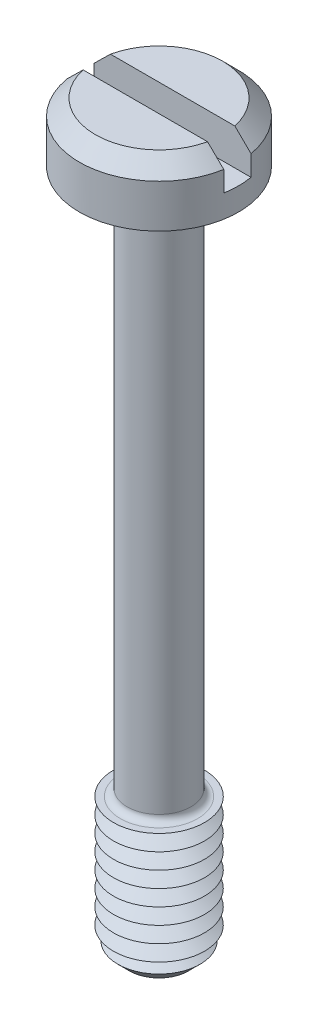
ISO-10303-21;
HEADER;
FILE_DESCRIPTION(('STEP AP214'),'2;1');
FILE_NAME('part.step','',(''),(''),'','','');
FILE_SCHEMA(('AUTOMOTIVE_DESIGN { 1 0 10303 214 1 1 1 1 }'));
ENDSEC;
DATA;
#1=APPLICATION_CONTEXT('core data for automotive mechanical design processes');
#2=APPLICATION_PROTOCOL_DEFINITION('international standard','automotive_design',2000,#1);
#3=PRODUCT_CONTEXT('',#1,'mechanical');
#4=PRODUCT('Part','Part','',(#3));
#5=PRODUCT_RELATED_PRODUCT_CATEGORY('part','',(#4));
#6=PRODUCT_DEFINITION_FORMATION('','',#4);
#7=PRODUCT_DEFINITION_CONTEXT('part definition',#1,'design');
#8=PRODUCT_DEFINITION('design','',#6,#7);
#9=PRODUCT_DEFINITION_SHAPE('','',#8);
#10=(LENGTH_UNIT() NAMED_UNIT(*) SI_UNIT(.MILLI.,.METRE.));
#11=(NAMED_UNIT(*) PLANE_ANGLE_UNIT() SI_UNIT($,.RADIAN.));
#12=(NAMED_UNIT(*) SI_UNIT($,.STERADIAN.) SOLID_ANGLE_UNIT());
#13=UNCERTAINTY_MEASURE_WITH_UNIT(LENGTH_MEASURE(1.E-05),#10,'distance_accuracy_value','');
#14=(GEOMETRIC_REPRESENTATION_CONTEXT(3) GLOBAL_UNCERTAINTY_ASSIGNED_CONTEXT((#13)) GLOBAL_UNIT_ASSIGNED_CONTEXT((#10,
#11,#12)) REPRESENTATION_CONTEXT('',''));
#15=CARTESIAN_POINT('',(0.,0.,0.));
#16=DIRECTION('',(0.,0.,1.));
#17=DIRECTION('',(1.,0.,0.));
#18=AXIS2_PLACEMENT_3D('',#15,#16,#17);
#19=CARTESIAN_POINT('',(0.,2.6,0.));
#20=DIRECTION('',(0.,1.,0.));
#21=DIRECTION('',(0.,0.,1.));
#22=AXIS2_PLACEMENT_3D('',#19,#20,#21);
#23=PLANE('',#22);
#24=DIRECTION('',(-1.,0.,0.));
#25=VECTOR('',#24,1.);
#26=CARTESIAN_POINT('',(3.5,2.6,-0.6));
#27=LINE('',#26,#25);
#28=CARTESIAN_POINT('',(2.73495886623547,2.6,-0.6));
#29=VERTEX_POINT('',#28);
#30=CARTESIAN_POINT('',(-2.73495886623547,2.6,-0.6));
#31=VERTEX_POINT('',#30);
#32=EDGE_CURVE('E110',#29,#31,#27,.T.);
#33=ORIENTED_EDGE('',*,*,#32,.F.);
#34=CARTESIAN_POINT('',(0.,2.6,0.));
#35=DIRECTION('',(0.,1.,0.));
#36=DIRECTION('',(0.,0.,1.));
#37=AXIS2_PLACEMENT_3D('',#34,#35,#36);
#38=CIRCLE('',#37,2.8);
#39=EDGE_CURVE('E113',#29,#31,#38,.T.);
#40=ORIENTED_EDGE('',*,*,#39,.T.);
#41=EDGE_LOOP('',(#33,#40));
#42=FACE_BOUND('',#41,.T.);
#43=ADVANCED_FACE('F39',(#42),#23,.T.);
#44=CARTESIAN_POINT('',(0.,2.6,0.));
#45=DIRECTION('',(0.,-1.,0.));
#46=DIRECTION('',(0.,0.,-1.));
#47=AXIS2_PLACEMENT_3D('',#44,#45,#46);
#48=CONICAL_SURFACE('',#47,2.8,0.785398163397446);
#49=CARTESIAN_POINT('',(7.69779986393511,-2.32114776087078,-0.6));
#50=CARTESIAN_POINT('',(7.42456340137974,-2.0487448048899,-0.6));
#51=CARTESIAN_POINT('',(7.15128998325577,-1.77637887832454,-0.6));
#52=CARTESIAN_POINT('',(6.60460779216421,-1.23176088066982,-0.6));
#53=CARTESIAN_POINT('',(6.3311990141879,-0.959508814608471,-0.6));
#54=CARTESIAN_POINT('',(5.78393918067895,-0.41491410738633,-0.6));
#55=CARTESIAN_POINT('',(5.51008795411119,-0.142571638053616,-0.6));
#56=CARTESIAN_POINT('',(4.96212493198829,0.401829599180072,-0.6));
#57=CARTESIAN_POINT('',(4.68801314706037,0.673888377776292,-0.6));
#58=CARTESIAN_POINT('',(4.15230810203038,1.204717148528,-0.6));
#59=CARTESIAN_POINT('',(3.89073524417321,1.4635077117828,-0.6));
#60=CARTESIAN_POINT('',(3.49781694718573,1.85115830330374,-0.6));
#61=CARTESIAN_POINT('',(3.36674319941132,1.98029362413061,-0.6));
#62=CARTESIAN_POINT('',(3.10433907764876,2.23830030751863,-0.6));
#63=CARTESIAN_POINT('',(2.97300870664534,2.36717167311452,-0.6));
#64=CARTESIAN_POINT('',(2.71005235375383,2.62445652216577,-0.6));
#65=CARTESIAN_POINT('',(2.57842659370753,2.75287023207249,-0.6));
#66=CARTESIAN_POINT('',(2.31459302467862,3.00911021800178,-0.6));
#67=CARTESIAN_POINT('',(2.1823851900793,3.13693646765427,-0.6));
#68=CARTESIAN_POINT('',(1.91706128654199,3.39159289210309,-0.6));
#69=CARTESIAN_POINT('',(1.78394541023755,3.51842326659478,-0.6));
#70=CARTESIAN_POINT('',(1.58297454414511,3.70728046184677,-0.6));
#71=CARTESIAN_POINT('',(1.51577053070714,3.76999922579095,-0.6));
#72=CARTESIAN_POINT('',(1.38073587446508,3.89475766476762,-0.6));
#73=CARTESIAN_POINT('',(1.31290524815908,3.95679735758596,-0.6));
#74=CARTESIAN_POINT('',(1.20662362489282,4.05253127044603,-0.6));
#75=CARTESIAN_POINT('',(1.16849592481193,4.08658409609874,-0.6));
#76=CARTESIAN_POINT('',(1.09186306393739,4.15427097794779,-0.6));
#77=CARTESIAN_POINT('',(1.05335786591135,4.18790499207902,-0.6));
#78=CARTESIAN_POINT('',(0.975560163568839,4.25487029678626,-0.6));
#79=CARTESIAN_POINT('',(0.936263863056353,4.28819718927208,-0.6));
#80=CARTESIAN_POINT('',(0.857023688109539,4.35405392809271,-0.6));
#81=CARTESIAN_POINT('',(0.817079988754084,4.38658398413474,-0.6));
#82=CARTESIAN_POINT('',(0.735932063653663,4.45080389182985,-0.6));
#83=CARTESIAN_POINT('',(0.694719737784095,4.48248357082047,-0.6));
#84=CARTESIAN_POINT('',(0.611023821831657,4.54411116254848,-0.6));
#85=CARTESIAN_POINT('',(0.568540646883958,4.57405963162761,-0.6));
#86=CARTESIAN_POINT('',(0.482031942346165,4.63104137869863,-0.6));
#87=CARTESIAN_POINT('',(0.438018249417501,4.65809235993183,-0.6));
#88=CARTESIAN_POINT('',(0.347545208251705,4.70764477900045,-0.6));
#89=CARTESIAN_POINT('',(0.301093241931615,4.73015905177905,-0.6));
#90=CARTESIAN_POINT('',(0.216840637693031,4.76288589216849,-0.6));
#91=CARTESIAN_POINT('',(0.179711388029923,4.77476119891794,-0.6));
#92=CARTESIAN_POINT('',(0.104069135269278,4.79214056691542,-0.6));
#93=CARTESIAN_POINT('',(0.0655630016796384,4.7976726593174,-0.6));
#94=CARTESIAN_POINT('',(-0.0121083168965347,4.80113734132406,-0.6));
#95=CARTESIAN_POINT('',(-0.0512762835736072,4.79901215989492,-0.6));
#96=CARTESIAN_POINT('',(-0.128601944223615,4.78758103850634,-0.6));
#97=CARTESIAN_POINT('',(-0.166755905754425,4.77825158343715,-0.6));
#98=CARTESIAN_POINT('',(-0.239985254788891,4.75468984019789,-0.6));
#99=CARTESIAN_POINT('',(-0.275121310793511,4.74063623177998,-0.6));
#100=CARTESIAN_POINT('',(-0.343859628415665,4.70912771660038,-0.6));
#101=CARTESIAN_POINT('',(-0.377459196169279,4.69166709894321,-0.6));
#102=CARTESIAN_POINT('',(-0.443620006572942,4.65431398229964,-0.6));
#103=CARTESIAN_POINT('',(-0.476170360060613,4.6344025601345,-0.6));
#104=CARTESIAN_POINT('',(-0.54020885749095,4.59301144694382,-0.6));
#105=CARTESIAN_POINT('',(-0.571697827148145,4.57153301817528,-0.6));
#106=CARTESIAN_POINT('',(-0.636426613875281,4.52565712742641,-0.6));
#107=CARTESIAN_POINT('',(-0.66959860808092,4.50116466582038,-0.6));
#108=CARTESIAN_POINT('',(-0.735238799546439,4.45125092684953,-0.6));
#109=CARTESIAN_POINT('',(-0.767706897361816,4.42582951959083,-0.6));
#110=CARTESIAN_POINT('',(-0.86434028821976,4.34853769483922,-0.6));
#111=CARTESIAN_POINT('',(-0.927700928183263,4.29566444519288,-0.6));
#112=CARTESIAN_POINT('',(-1.05322030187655,4.18829389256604,-0.6));
#113=CARTESIAN_POINT('',(-1.11537654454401,4.13379371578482,-0.6));
#114=CARTESIAN_POINT('',(-1.23879800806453,4.02383276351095,-0.6));
#115=CARTESIAN_POINT('',(-1.30006349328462,3.96837228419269,-0.6));
#116=CARTESIAN_POINT('',(-1.42182653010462,3.85695373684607,-0.6));
#117=CARTESIAN_POINT('',(-1.4823257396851,3.80099747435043,-0.6));
#118=CARTESIAN_POINT('',(-1.60290045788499,3.68862177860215,-0.6));
#119=CARTESIAN_POINT('',(-1.66297593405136,3.63220231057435,-0.6));
#120=CARTESIAN_POINT('',(-1.84259490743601,3.4625819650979,-0.6));
#121=CARTESIAN_POINT('',(-1.96167258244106,3.3488883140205,-0.6));
#122=CARTESIAN_POINT('',(-2.19942862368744,3.12043467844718,-0.6));
#123=CARTESIAN_POINT('',(-2.3181049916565,3.00567262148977,-0.6));
#124=CARTESIAN_POINT('',(-2.55498513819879,2.77566147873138,-0.6));
#125=CARTESIAN_POINT('',(-2.67318891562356,2.66041239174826,-0.6));
#126=CARTESIAN_POINT('',(-3.02733776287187,2.31418176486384,-0.6));
#127=CARTESIAN_POINT('',(-3.26281496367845,2.08272206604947,-0.6));
#128=CARTESIAN_POINT('',(-3.73326607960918,1.61902814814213,-0.6));
#129=CARTESIAN_POINT('',(-3.96823963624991,1.38679356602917,-0.6));
#130=CARTESIAN_POINT('',(-4.43780370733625,0.921942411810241,-0.6));
#131=CARTESIAN_POINT('',(-4.67239422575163,0.689325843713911,-0.6));
#132=CARTESIAN_POINT('',(-5.13982382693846,0.225350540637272,-0.6));
#133=CARTESIAN_POINT('',(-5.37266445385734,-0.0060066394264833,-0.6));
#134=CARTESIAN_POINT('',(-5.8381854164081,-0.468883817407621,-0.6));
#135=CARTESIAN_POINT('',(-6.07086575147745,-0.700403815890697,-0.6));
#136=CARTESIAN_POINT('',(-6.5359692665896,-1.16341429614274,-0.6));
#137=CARTESIAN_POINT('',(-6.76839251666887,-1.39490470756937,-0.6));
#138=CARTESIAN_POINT('',(-7.23315324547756,-1.85796986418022,-0.6));
#139=CARTESIAN_POINT('',(-7.46549072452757,-2.08954460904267,-0.6));
#140=CARTESIAN_POINT('',(-7.69779986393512,-2.32114776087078,-0.6));
#141=B_SPLINE_CURVE_WITH_KNOTS('',3,(#49,#50,#51,#52,#53,#54,#55,#56,#57,#58,#59,#60,#61,#62,
#63,#64,#65,#66,#67,#68,#69,#70,#71,#72,#73,#74,#75,#76,#77,#78,#79,#80,#81,#82,#83,#84,#85,#86,
#87,#88,#89,#90,#91,#92,#93,#94,#95,#96,#97,#98,#99,#100,#101,#102,#103,#104,#105,#106,#107,
#108,#109,#110,#111,#112,#113,#114,#115,#116,#117,#118,#119,#120,#121,#122,#123,#124,#125,#126,
#127,#128,#129,#130,#131,#132,#133,#134,#135,#136,#137,#138,#139,#140),.UNSPECIFIED.,.F.,.F.,(4,
2,2,2,2,2,2,2,2,2,2,2,2,2,2,2,2,2,2,2,2,2,2,2,2,2,2,2,2,2,2,2,2,2,2,2,2,2,2,2,2,2,2,2,2,4),(0.,
1.15747738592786,2.31500139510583,3.47365747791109,4.6322681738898,5.73614050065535,
6.28814234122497,6.84013779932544,7.39180548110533,7.94349768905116,8.49507629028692,
8.7708456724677,9.04660781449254,9.19996738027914,9.35334222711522,9.50791164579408,
9.66243993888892,9.81835637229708,9.97422241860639,10.1290741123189,10.2834813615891,
10.4000294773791,10.5160605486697,10.6329688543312,10.7502603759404,10.8635386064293,
10.9770083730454,11.0914168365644,11.205734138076,11.3294140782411,11.4531113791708,
11.7006314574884,11.9486181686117,12.1965297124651,12.4437540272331,12.6909970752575,
13.184904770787,13.6801705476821,14.1754375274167,15.1659939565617,16.1571087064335,
17.1482131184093,18.1329303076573,19.1176509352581,20.1017623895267,21.0858701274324),.UNSPECIFIED.);
#142=CARTESIAN_POINT('',(3.44818792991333,1.9,-0.6));
#143=VERTEX_POINT('',#142);
#144=EDGE_CURVE('E260',#143,#29,#141,.T.);
#145=ORIENTED_EDGE('',*,*,#144,.F.);
#146=CARTESIAN_POINT('',(0.,1.9,0.));
#147=DIRECTION('',(0.,1.,0.));
#148=DIRECTION('',(0.,0.,1.));
#149=AXIS2_PLACEMENT_3D('',#146,#147,#148);
#150=CIRCLE('',#149,3.5);
#151=CARTESIAN_POINT('',(-3.44818792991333,1.9,-0.6));
#152=VERTEX_POINT('',#151);
#153=EDGE_CURVE('E128',#152,#143,#150,.F.);
#154=ORIENTED_EDGE('',*,*,#153,.F.);
#155=EDGE_CURVE('E102',#31,#152,#141,.T.);
#156=ORIENTED_EDGE('',*,*,#155,.F.);
#157=ORIENTED_EDGE('',*,*,#39,.F.);
#158=EDGE_LOOP('',(#145,#154,#156,#157));
#159=FACE_BOUND('',#158,.T.);
#160=ADVANCED_FACE('F222',(#159),#48,.T.);
#161=CARTESIAN_POINT('',(0.,-30.,0.));
#162=DIRECTION('',(0.,1.,0.));
#163=DIRECTION('',(0.,0.,1.));
#164=AXIS2_PLACEMENT_3D('',#161,#162,#163);
#165=CYLINDRICAL_SURFACE('',#164,1.4);
#166=CARTESIAN_POINT('',(0.,-23.7,0.));
#167=DIRECTION('',(0.,-1.,0.));
#168=DIRECTION('',(0.,0.,-1.));
#169=AXIS2_PLACEMENT_3D('',#166,#167,#168);
#170=CIRCLE('',#169,1.4);
#171=CARTESIAN_POINT('',(0.,-23.7,-1.4));
#172=VERTEX_POINT('',#171);
#173=EDGE_CURVE('E123',#172,#172,#170,.F.);
#174=ORIENTED_EDGE('',*,*,#173,.T.);
#175=EDGE_LOOP('',(#174));
#176=FACE_BOUND('',#175,.T.);
#177=CARTESIAN_POINT('',(0.,-0.300000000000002,0.));
#178=DIRECTION('',(0.,1.,0.));
#179=DIRECTION('',(0.,0.,1.));
#180=AXIS2_PLACEMENT_3D('',#177,#178,#179);
#181=CIRCLE('',#180,1.4);
#182=CARTESIAN_POINT('',(0.,-0.300000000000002,1.4));
#183=VERTEX_POINT('',#182);
#184=EDGE_CURVE('E365',#183,#183,#181,.F.);
#185=ORIENTED_EDGE('',*,*,#184,.T.);
#186=EDGE_LOOP('',(#185));
#187=FACE_BOUND('',#186,.T.);
#188=ADVANCED_FACE('F218',(#176,#187),#165,.T.);
#189=CARTESIAN_POINT('',(0.,2.6,0.));
#190=DIRECTION('',(0.,-1.,0.));
#191=DIRECTION('',(0.,0.,-1.));
#192=AXIS2_PLACEMENT_3D('',#189,#190,#191);
#193=CYLINDRICAL_SURFACE('',#192,3.5);
#194=ORIENTED_EDGE('',*,*,#153,.T.);
#195=DIRECTION('',(0.,-1.,0.));
#196=VECTOR('',#195,1.);
#197=CARTESIAN_POINT('',(3.44818792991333,2.6,-0.6));
#198=LINE('',#197,#196);
#199=CARTESIAN_POINT('',(3.44818792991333,1.,-0.6));
#200=VERTEX_POINT('',#199);
#201=EDGE_CURVE('E64',#143,#200,#198,.T.);
#202=ORIENTED_EDGE('',*,*,#201,.T.);
#203=CARTESIAN_POINT('',(0.,1.,0.));
#204=DIRECTION('',(0.,1.,0.));
#205=DIRECTION('',(0.,0.,1.));
#206=AXIS2_PLACEMENT_3D('',#203,#204,#205);
#207=CIRCLE('',#206,3.5);
#208=CARTESIAN_POINT('',(3.44818792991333,1.,0.6));
#209=VERTEX_POINT('',#208);
#210=EDGE_CURVE('E11',#209,#200,#207,.T.);
#211=ORIENTED_EDGE('',*,*,#210,.F.);
#212=DIRECTION('',(0.,-1.,0.));
#213=VECTOR('',#212,1.);
#214=CARTESIAN_POINT('',(3.44818792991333,2.6,0.6));
#215=LINE('',#214,#213);
#216=CARTESIAN_POINT('',(3.44818792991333,1.9,0.6));
#217=VERTEX_POINT('',#216);
#218=EDGE_CURVE('E278',#209,#217,#215,.F.);
#219=ORIENTED_EDGE('',*,*,#218,.T.);
#220=CARTESIAN_POINT('',(-3.44818792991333,1.9,0.6));
#221=VERTEX_POINT('',#220);
#222=EDGE_CURVE('E120',#217,#221,#150,.F.);
#223=ORIENTED_EDGE('',*,*,#222,.T.);
#224=DIRECTION('',(0.,-1.,0.));
#225=VECTOR('',#224,1.);
#226=CARTESIAN_POINT('',(-3.44818792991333,2.6,0.6));
#227=LINE('',#226,#225);
#228=CARTESIAN_POINT('',(-3.44818792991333,1.,0.6));
#229=VERTEX_POINT('',#228);
#230=EDGE_CURVE('E96',#221,#229,#227,.T.);
#231=ORIENTED_EDGE('',*,*,#230,.T.);
#232=CARTESIAN_POINT('',(-3.44818792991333,1.,-0.6));
#233=VERTEX_POINT('',#232);
#234=EDGE_CURVE('E44',#233,#229,#207,.T.);
#235=ORIENTED_EDGE('',*,*,#234,.F.);
#236=DIRECTION('',(0.,-1.,0.));
#237=VECTOR('',#236,1.);
#238=CARTESIAN_POINT('',(-3.44818792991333,2.6,-0.6));
#239=LINE('',#238,#237);
#240=EDGE_CURVE('E283',#233,#152,#239,.F.);
#241=ORIENTED_EDGE('',*,*,#240,.T.);
#242=EDGE_LOOP('',(#194,#202,#211,#219,#223,#231,#235,#241));
#243=FACE_BOUND('',#242,.T.);
#244=CARTESIAN_POINT('',(0.,0.,0.));
#245=DIRECTION('',(0.,1.,0.));
#246=DIRECTION('',(0.,0.,1.));
#247=AXIS2_PLACEMENT_3D('',#244,#245,#246);
#248=CIRCLE('',#247,3.5);
#249=CARTESIAN_POINT('',(0.,0.,3.5));
#250=VERTEX_POINT('',#249);
#251=EDGE_CURVE('E351',#250,#250,#248,.T.);
#252=ORIENTED_EDGE('',*,*,#251,.T.);
#253=EDGE_LOOP('',(#252));
#254=FACE_BOUND('',#253,.T.);
#255=ADVANCED_FACE('F221',(#243,#254),#193,.T.);
#256=DIRECTION('',(1.,0.,0.));
#257=VECTOR('',#256,1.);
#258=CARTESIAN_POINT('',(3.5,2.6,0.6));
#259=LINE('',#258,#257);
#260=CARTESIAN_POINT('',(-2.73495886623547,2.6,0.6));
#261=VERTEX_POINT('',#260);
#262=CARTESIAN_POINT('',(2.73495886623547,2.6,0.6));
#263=VERTEX_POINT('',#262);
#264=EDGE_CURVE('E56',#261,#263,#259,.T.);
#265=ORIENTED_EDGE('',*,*,#264,.F.);
#266=EDGE_CURVE('E108',#261,#263,#38,.T.);
#267=ORIENTED_EDGE('',*,*,#266,.T.);
#268=EDGE_LOOP('',(#265,#267));
#269=FACE_BOUND('',#268,.T.);
#270=ADVANCED_FACE('F107',(#269),#23,.T.);
#271=CARTESIAN_POINT('',(0.,0.,0.));
#272=DIRECTION('',(0.,1.,0.));
#273=DIRECTION('',(0.,0.,1.));
#274=AXIS2_PLACEMENT_3D('',#271,#272,#273);
#275=PLANE('',#274);
#276=CARTESIAN_POINT('',(0.,0.,0.));
#277=DIRECTION('',(0.,1.,0.));
#278=DIRECTION('',(0.,0.,1.));
#279=AXIS2_PLACEMENT_3D('',#276,#277,#278);
#280=CIRCLE('',#279,1.7);
#281=CARTESIAN_POINT('',(0.,0.,1.7));
#282=VERTEX_POINT('',#281);
#283=EDGE_CURVE('E114',#282,#282,#280,.T.);
#284=ORIENTED_EDGE('',*,*,#283,.T.);
#285=EDGE_LOOP('',(#284));
#286=FACE_BOUND('',#285,.T.);
#287=ORIENTED_EDGE('',*,*,#251,.F.);
#288=EDGE_LOOP('',(#287));
#289=FACE_BOUND('',#288,.T.);
#290=ADVANCED_FACE('F212',(#286,#289),#275,.F.);
#291=CARTESIAN_POINT('',(0.,-24.,0.));
#292=DIRECTION('',(0.,-1.,0.));
#293=DIRECTION('',(0.,0.,-1.));
#294=AXIS2_PLACEMENT_3D('',#291,#292,#293);
#295=PLANE('',#294);
#296=CARTESIAN_POINT('',(0.,-24.,0.));
#297=DIRECTION('',(0.,-1.,0.));
#298=DIRECTION('',(0.,0.,-1.));
#299=AXIS2_PLACEMENT_3D('',#296,#297,#298);
#300=CIRCLE('',#299,1.7);
#301=CARTESIAN_POINT('',(0.,-24.,-1.7));
#302=VERTEX_POINT('',#301);
#303=EDGE_CURVE('E359',#302,#302,#300,.T.);
#304=ORIENTED_EDGE('',*,*,#303,.T.);
#305=EDGE_LOOP('',(#304));
#306=FACE_BOUND('',#305,.T.);
#307=CARTESIAN_POINT('',(0.,-24.,0.));
#308=DIRECTION('',(0.,1.,0.));
#309=DIRECTION('',(0.,0.,1.));
#310=AXIS2_PLACEMENT_3D('',#307,#308,#309);
#311=CIRCLE('',#310,2.);
#312=CARTESIAN_POINT('',(0.,-24.,2.));
#313=VERTEX_POINT('',#312);
#314=EDGE_CURVE('E347',#313,#313,#311,.T.);
#315=ORIENTED_EDGE('',*,*,#314,.T.);
#316=EDGE_LOOP('',(#315));
#317=FACE_BOUND('',#316,.T.);
#318=ADVANCED_FACE('F208',(#306,#317),#295,.F.);
#319=CARTESIAN_POINT('',(0.,-24.35,0.));
#320=DIRECTION('',(0.,1.,0.));
#321=DIRECTION('',(0.,0.,1.));
#322=AXIS2_PLACEMENT_3D('',#319,#320,#321);
#323=CONICAL_SURFACE('',#322,1.39378221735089,1.0471975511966);
#324=ORIENTED_EDGE('',*,*,#314,.F.);
#325=EDGE_LOOP('',(#324));
#326=FACE_BOUND('',#325,.T.);
#327=CARTESIAN_POINT('',(0.,-24.35,0.));
#328=DIRECTION('',(0.,1.,0.));
#329=DIRECTION('',(0.,0.,1.));
#330=AXIS2_PLACEMENT_3D('',#327,#328,#329);
#331=CIRCLE('',#330,1.39378221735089);
#332=CARTESIAN_POINT('',(0.,-24.35,1.39378221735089));
#333=VERTEX_POINT('',#332);
#334=EDGE_CURVE('E343',#333,#333,#331,.T.);
#335=ORIENTED_EDGE('',*,*,#334,.T.);
#336=EDGE_LOOP('',(#335));
#337=FACE_BOUND('',#336,.T.);
#338=ADVANCED_FACE('F204',(#326,#337),#323,.T.);
#339=CARTESIAN_POINT('',(0.,-24.7,0.));
#340=DIRECTION('',(0.,-1.,0.));
#341=DIRECTION('',(0.,0.,-1.));
#342=AXIS2_PLACEMENT_3D('',#339,#340,#341);
#343=CONICAL_SURFACE('',#342,2.,1.0471975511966);
#344=ORIENTED_EDGE('',*,*,#334,.F.);
#345=EDGE_LOOP('',(#344));
#346=FACE_BOUND('',#345,.T.);
#347=CARTESIAN_POINT('',(0.,-24.7,0.));
#348=DIRECTION('',(0.,1.,0.));
#349=DIRECTION('',(0.,0.,1.));
#350=AXIS2_PLACEMENT_3D('',#347,#348,#349);
#351=CIRCLE('',#350,2.);
#352=CARTESIAN_POINT('',(0.,-24.7,2.));
#353=VERTEX_POINT('',#352);
#354=EDGE_CURVE('E339',#353,#353,#351,.T.);
#355=ORIENTED_EDGE('',*,*,#354,.T.);
#356=EDGE_LOOP('',(#355));
#357=FACE_BOUND('',#356,.T.);
#358=ADVANCED_FACE('F200',(#346,#357),#343,.T.);
#359=CARTESIAN_POINT('',(0.,-25.05,0.));
#360=DIRECTION('',(0.,1.,0.));
#361=DIRECTION('',(0.,0.,1.));
#362=AXIS2_PLACEMENT_3D('',#359,#360,#361);
#363=CONICAL_SURFACE('',#362,1.39378221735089,1.0471975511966);
#364=ORIENTED_EDGE('',*,*,#354,.F.);
#365=EDGE_LOOP('',(#364));
#366=FACE_BOUND('',#365,.T.);
#367=CARTESIAN_POINT('',(0.,-25.05,0.));
#368=DIRECTION('',(0.,1.,0.));
#369=DIRECTION('',(0.,0.,1.));
#370=AXIS2_PLACEMENT_3D('',#367,#368,#369);
#371=CIRCLE('',#370,1.39378221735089);
#372=CARTESIAN_POINT('',(0.,-25.05,1.39378221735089));
#373=VERTEX_POINT('',#372);
#374=EDGE_CURVE('E335',#373,#373,#371,.T.);
#375=ORIENTED_EDGE('',*,*,#374,.T.);
#376=EDGE_LOOP('',(#375));
#377=FACE_BOUND('',#376,.T.);
#378=ADVANCED_FACE('F196',(#366,#377),#363,.T.);
#379=CARTESIAN_POINT('',(0.,-25.4,0.));
#380=DIRECTION('',(0.,-1.,0.));
#381=DIRECTION('',(0.,0.,-1.));
#382=AXIS2_PLACEMENT_3D('',#379,#380,#381);
#383=CONICAL_SURFACE('',#382,2.,1.0471975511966);
#384=ORIENTED_EDGE('',*,*,#374,.F.);
#385=EDGE_LOOP('',(#384));
#386=FACE_BOUND('',#385,.T.);
#387=CARTESIAN_POINT('',(0.,-25.4,0.));
#388=DIRECTION('',(0.,1.,0.));
#389=DIRECTION('',(0.,0.,1.));
#390=AXIS2_PLACEMENT_3D('',#387,#388,#389);
#391=CIRCLE('',#390,2.);
#392=CARTESIAN_POINT('',(0.,-25.4,2.));
#393=VERTEX_POINT('',#392);
#394=EDGE_CURVE('E332',#393,#393,#391,.T.);
#395=ORIENTED_EDGE('',*,*,#394,.T.);
#396=EDGE_LOOP('',(#395));
#397=FACE_BOUND('',#396,.T.);
#398=ADVANCED_FACE('F192',(#386,#397),#383,.T.);
#399=CARTESIAN_POINT('',(0.,-25.75,0.));
#400=DIRECTION('',(0.,1.,0.));
#401=DIRECTION('',(0.,0.,1.));
#402=AXIS2_PLACEMENT_3D('',#399,#400,#401);
#403=CONICAL_SURFACE('',#402,1.39378221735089,1.0471975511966);
#404=ORIENTED_EDGE('',*,*,#394,.F.);
#405=EDGE_LOOP('',(#404));
#406=FACE_BOUND('',#405,.T.);
#407=CARTESIAN_POINT('',(0.,-25.75,0.));
#408=DIRECTION('',(0.,1.,0.));
#409=DIRECTION('',(0.,0.,1.));
#410=AXIS2_PLACEMENT_3D('',#407,#408,#409);
#411=CIRCLE('',#410,1.39378221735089);
#412=CARTESIAN_POINT('',(0.,-25.75,1.39378221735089));
#413=VERTEX_POINT('',#412);
#414=EDGE_CURVE('E329',#413,#413,#411,.T.);
#415=ORIENTED_EDGE('',*,*,#414,.T.);
#416=EDGE_LOOP('',(#415));
#417=FACE_BOUND('',#416,.T.);
#418=ADVANCED_FACE('F188',(#406,#417),#403,.T.);
#419=CARTESIAN_POINT('',(0.,-26.1,0.));
#420=DIRECTION('',(0.,-1.,0.));
#421=DIRECTION('',(0.,0.,-1.));
#422=AXIS2_PLACEMENT_3D('',#419,#420,#421);
#423=CONICAL_SURFACE('',#422,2.,1.0471975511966);
#424=ORIENTED_EDGE('',*,*,#414,.F.);
#425=EDGE_LOOP('',(#424));
#426=FACE_BOUND('',#425,.T.);
#427=CARTESIAN_POINT('',(0.,-26.1,0.));
#428=DIRECTION('',(0.,1.,0.));
#429=DIRECTION('',(0.,0.,1.));
#430=AXIS2_PLACEMENT_3D('',#427,#428,#429);
#431=CIRCLE('',#430,2.);
#432=CARTESIAN_POINT('',(0.,-26.1,2.));
#433=VERTEX_POINT('',#432);
#434=EDGE_CURVE('E326',#433,#433,#431,.T.);
#435=ORIENTED_EDGE('',*,*,#434,.T.);
#436=EDGE_LOOP('',(#435));
#437=FACE_BOUND('',#436,.T.);
#438=ADVANCED_FACE('F184',(#426,#437),#423,.T.);
#439=CARTESIAN_POINT('',(0.,-26.45,0.));
#440=DIRECTION('',(0.,1.,0.));
#441=DIRECTION('',(0.,0.,1.));
#442=AXIS2_PLACEMENT_3D('',#439,#440,#441);
#443=CONICAL_SURFACE('',#442,1.39378221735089,1.0471975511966);
#444=ORIENTED_EDGE('',*,*,#434,.F.);
#445=EDGE_LOOP('',(#444));
#446=FACE_BOUND('',#445,.T.);
#447=CARTESIAN_POINT('',(0.,-26.45,0.));
#448=DIRECTION('',(0.,1.,0.));
#449=DIRECTION('',(0.,0.,1.));
#450=AXIS2_PLACEMENT_3D('',#447,#448,#449);
#451=CIRCLE('',#450,1.39378221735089);
#452=CARTESIAN_POINT('',(0.,-26.45,1.39378221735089));
#453=VERTEX_POINT('',#452);
#454=EDGE_CURVE('E323',#453,#453,#451,.T.);
#455=ORIENTED_EDGE('',*,*,#454,.T.);
#456=EDGE_LOOP('',(#455));
#457=FACE_BOUND('',#456,.T.);
#458=ADVANCED_FACE('F180',(#446,#457),#443,.T.);
#459=CARTESIAN_POINT('',(0.,-26.8,0.));
#460=DIRECTION('',(0.,-1.,0.));
#461=DIRECTION('',(0.,0.,-1.));
#462=AXIS2_PLACEMENT_3D('',#459,#460,#461);
#463=CONICAL_SURFACE('',#462,2.,1.0471975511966);
#464=ORIENTED_EDGE('',*,*,#454,.F.);
#465=EDGE_LOOP('',(#464));
#466=FACE_BOUND('',#465,.T.);
#467=CARTESIAN_POINT('',(0.,-26.8,0.));
#468=DIRECTION('',(0.,1.,0.));
#469=DIRECTION('',(0.,0.,1.));
#470=AXIS2_PLACEMENT_3D('',#467,#468,#469);
#471=CIRCLE('',#470,2.);
#472=CARTESIAN_POINT('',(0.,-26.8,2.));
#473=VERTEX_POINT('',#472);
#474=EDGE_CURVE('E319',#473,#473,#471,.T.);
#475=ORIENTED_EDGE('',*,*,#474,.T.);
#476=EDGE_LOOP('',(#475));
#477=FACE_BOUND('',#476,.T.);
#478=ADVANCED_FACE('F176',(#466,#477),#463,.T.);
#479=CARTESIAN_POINT('',(0.,-27.15,0.));
#480=DIRECTION('',(0.,1.,0.));
#481=DIRECTION('',(0.,0.,1.));
#482=AXIS2_PLACEMENT_3D('',#479,#480,#481);
#483=CONICAL_SURFACE('',#482,1.39378221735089,1.0471975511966);
#484=ORIENTED_EDGE('',*,*,#474,.F.);
#485=EDGE_LOOP('',(#484));
#486=FACE_BOUND('',#485,.T.);
#487=CARTESIAN_POINT('',(0.,-27.15,0.));
#488=DIRECTION('',(0.,1.,0.));
#489=DIRECTION('',(0.,0.,1.));
#490=AXIS2_PLACEMENT_3D('',#487,#488,#489);
#491=CIRCLE('',#490,1.39378221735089);
#492=CARTESIAN_POINT('',(0.,-27.15,1.39378221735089));
#493=VERTEX_POINT('',#492);
#494=EDGE_CURVE('E315',#493,#493,#491,.T.);
#495=ORIENTED_EDGE('',*,*,#494,.T.);
#496=EDGE_LOOP('',(#495));
#497=FACE_BOUND('',#496,.T.);
#498=ADVANCED_FACE('F172',(#486,#497),#483,.T.);
#499=CARTESIAN_POINT('',(0.,-27.5,0.));
#500=DIRECTION('',(0.,-1.,0.));
#501=DIRECTION('',(0.,0.,-1.));
#502=AXIS2_PLACEMENT_3D('',#499,#500,#501);
#503=CONICAL_SURFACE('',#502,2.,1.0471975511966);
#504=ORIENTED_EDGE('',*,*,#494,.F.);
#505=EDGE_LOOP('',(#504));
#506=FACE_BOUND('',#505,.T.);
#507=CARTESIAN_POINT('',(0.,-27.5,0.));
#508=DIRECTION('',(0.,1.,0.));
#509=DIRECTION('',(0.,0.,1.));
#510=AXIS2_PLACEMENT_3D('',#507,#508,#509);
#511=CIRCLE('',#510,2.);
#512=CARTESIAN_POINT('',(0.,-27.5,2.));
#513=VERTEX_POINT('',#512);
#514=EDGE_CURVE('E311',#513,#513,#511,.T.);
#515=ORIENTED_EDGE('',*,*,#514,.T.);
#516=EDGE_LOOP('',(#515));
#517=FACE_BOUND('',#516,.T.);
#518=ADVANCED_FACE('F168',(#506,#517),#503,.T.);
#519=CARTESIAN_POINT('',(0.,-27.85,0.));
#520=DIRECTION('',(0.,1.,0.));
#521=DIRECTION('',(0.,0.,1.));
#522=AXIS2_PLACEMENT_3D('',#519,#520,#521);
#523=CONICAL_SURFACE('',#522,1.39378221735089,1.0471975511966);
#524=ORIENTED_EDGE('',*,*,#514,.F.);
#525=EDGE_LOOP('',(#524));
#526=FACE_BOUND('',#525,.T.);
#527=CARTESIAN_POINT('',(0.,-27.85,0.));
#528=DIRECTION('',(0.,1.,0.));
#529=DIRECTION('',(0.,0.,1.));
#530=AXIS2_PLACEMENT_3D('',#527,#528,#529);
#531=CIRCLE('',#530,1.39378221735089);
#532=CARTESIAN_POINT('',(0.,-27.85,1.39378221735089));
#533=VERTEX_POINT('',#532);
#534=EDGE_CURVE('E307',#533,#533,#531,.T.);
#535=ORIENTED_EDGE('',*,*,#534,.T.);
#536=EDGE_LOOP('',(#535));
#537=FACE_BOUND('',#536,.T.);
#538=ADVANCED_FACE('F164',(#526,#537),#523,.T.);
#539=CARTESIAN_POINT('',(0.,-28.2,0.));
#540=DIRECTION('',(0.,-1.,0.));
#541=DIRECTION('',(0.,0.,-1.));
#542=AXIS2_PLACEMENT_3D('',#539,#540,#541);
#543=CONICAL_SURFACE('',#542,2.,1.0471975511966);
#544=ORIENTED_EDGE('',*,*,#534,.F.);
#545=EDGE_LOOP('',(#544));
#546=FACE_BOUND('',#545,.T.);
#547=CARTESIAN_POINT('',(0.,-28.2,0.));
#548=DIRECTION('',(0.,1.,0.));
#549=DIRECTION('',(0.,0.,1.));
#550=AXIS2_PLACEMENT_3D('',#547,#548,#549);
#551=CIRCLE('',#550,2.);
#552=CARTESIAN_POINT('',(0.,-28.2,2.));
#553=VERTEX_POINT('',#552);
#554=EDGE_CURVE('E303',#553,#553,#551,.T.);
#555=ORIENTED_EDGE('',*,*,#554,.T.);
#556=EDGE_LOOP('',(#555));
#557=FACE_BOUND('',#556,.T.);
#558=ADVANCED_FACE('F160',(#546,#557),#543,.T.);
#559=CARTESIAN_POINT('',(0.,-28.55,0.));
#560=DIRECTION('',(0.,1.,0.));
#561=DIRECTION('',(0.,0.,1.));
#562=AXIS2_PLACEMENT_3D('',#559,#560,#561);
#563=CONICAL_SURFACE('',#562,1.39378221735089,1.0471975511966);
#564=ORIENTED_EDGE('',*,*,#554,.F.);
#565=EDGE_LOOP('',(#564));
#566=FACE_BOUND('',#565,.T.);
#567=CARTESIAN_POINT('',(0.,-28.55,0.));
#568=DIRECTION('',(0.,1.,0.));
#569=DIRECTION('',(0.,0.,1.));
#570=AXIS2_PLACEMENT_3D('',#567,#568,#569);
#571=CIRCLE('',#570,1.39378221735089);
#572=CARTESIAN_POINT('',(0.,-28.55,1.39378221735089));
#573=VERTEX_POINT('',#572);
#574=EDGE_CURVE('E300',#573,#573,#571,.T.);
#575=ORIENTED_EDGE('',*,*,#574,.T.);
#576=EDGE_LOOP('',(#575));
#577=FACE_BOUND('',#576,.T.);
#578=ADVANCED_FACE('F156',(#566,#577),#563,.T.);
#579=CARTESIAN_POINT('',(0.,-28.9,0.));
#580=DIRECTION('',(0.,-1.,0.));
#581=DIRECTION('',(0.,0.,-1.));
#582=AXIS2_PLACEMENT_3D('',#579,#580,#581);
#583=CONICAL_SURFACE('',#582,2.,1.0471975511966);
#584=ORIENTED_EDGE('',*,*,#574,.F.);
#585=EDGE_LOOP('',(#584));
#586=FACE_BOUND('',#585,.T.);
#587=CARTESIAN_POINT('',(0.,-28.9,0.));
#588=DIRECTION('',(0.,1.,0.));
#589=DIRECTION('',(0.,0.,1.));
#590=AXIS2_PLACEMENT_3D('',#587,#588,#589);
#591=CIRCLE('',#590,2.);
#592=CARTESIAN_POINT('',(0.,-28.9,2.));
#593=VERTEX_POINT('',#592);
#594=EDGE_CURVE('E295',#593,#593,#591,.T.);
#595=ORIENTED_EDGE('',*,*,#594,.T.);
#596=EDGE_LOOP('',(#595));
#597=FACE_BOUND('',#596,.T.);
#598=ADVANCED_FACE('F152',(#586,#597),#583,.T.);
#599=CARTESIAN_POINT('',(0.,-29.25,0.));
#600=DIRECTION('',(0.,1.,0.));
#601=DIRECTION('',(0.,0.,1.));
#602=AXIS2_PLACEMENT_3D('',#599,#600,#601);
#603=CONICAL_SURFACE('',#602,1.39378221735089,1.0471975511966);
#604=ORIENTED_EDGE('',*,*,#594,.F.);
#605=EDGE_LOOP('',(#604));
#606=FACE_BOUND('',#605,.T.);
#607=CARTESIAN_POINT('',(0.,-29.25,0.));
#608=DIRECTION('',(0.,1.,0.));
#609=DIRECTION('',(0.,0.,1.));
#610=AXIS2_PLACEMENT_3D('',#607,#608,#609);
#611=CIRCLE('',#610,1.39378221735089);
#612=CARTESIAN_POINT('',(0.,-29.25,1.39378221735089));
#613=VERTEX_POINT('',#612);
#614=EDGE_CURVE('E291',#613,#613,#611,.T.);
#615=ORIENTED_EDGE('',*,*,#614,.T.);
#616=EDGE_LOOP('',(#615));
#617=FACE_BOUND('',#616,.T.);
#618=ADVANCED_FACE('F148',(#606,#617),#603,.T.);
#619=CARTESIAN_POINT('',(0.,-29.6,0.));
#620=DIRECTION('',(0.,-1.,0.));
#621=DIRECTION('',(0.,0.,-1.));
#622=AXIS2_PLACEMENT_3D('',#619,#620,#621);
#623=CONICAL_SURFACE('',#622,2.,1.0471975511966);
#624=CARTESIAN_POINT('',(0.,-29.4901923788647,0.));
#625=DIRECTION('',(0.,-1.,0.));
#626=DIRECTION('',(0.,0.,-1.));
#627=AXIS2_PLACEMENT_3D('',#624,#625,#626);
#628=CIRCLE('',#627,1.80980762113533);
#629=CARTESIAN_POINT('',(0.,-29.4901923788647,1.80980762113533));
#630=VERTEX_POINT('',#629);
#631=EDGE_CURVE('E299',#630,#630,#628,.F.);
#632=ORIENTED_EDGE('',*,*,#631,.T.);
#633=EDGE_LOOP('',(#632));
#634=FACE_BOUND('',#633,.T.);
#635=ORIENTED_EDGE('',*,*,#614,.F.);
#636=EDGE_LOOP('',(#635));
#637=FACE_BOUND('',#636,.T.);
#638=ADVANCED_FACE('F144',(#634,#637),#623,.T.);
#639=CARTESIAN_POINT('',(0.,-30.,0.));
#640=DIRECTION('',(0.,-1.,0.));
#641=DIRECTION('',(0.,0.,-1.));
#642=AXIS2_PLACEMENT_3D('',#639,#640,#641);
#643=PLANE('',#642);
#644=CARTESIAN_POINT('',(0.,-30.,0.));
#645=DIRECTION('',(0.,-1.,0.));
#646=DIRECTION('',(0.,0.,-1.));
#647=AXIS2_PLACEMENT_3D('',#644,#645,#646);
#648=CIRCLE('',#647,1.3);
#649=CARTESIAN_POINT('',(0.,-30.,1.3));
#650=VERTEX_POINT('',#649);
#651=EDGE_CURVE('E355',#650,#650,#648,.T.);
#652=ORIENTED_EDGE('',*,*,#651,.T.);
#653=EDGE_LOOP('',(#652));
#654=FACE_BOUND('',#653,.T.);
#655=ADVANCED_FACE('F147',(#654),#643,.T.);
#656=CARTESIAN_POINT('',(0.,-30.,0.));
#657=DIRECTION('',(0.,1.,0.));
#658=DIRECTION('',(0.,0.,1.));
#659=AXIS2_PLACEMENT_3D('',#656,#657,#658);
#660=CONICAL_SURFACE('',#659,1.3,0.785398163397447);
#661=CARTESIAN_POINT('',(0.,-29.4901923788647,1.80980762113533));
#662=CARTESIAN_POINT('',(0.,-29.4955028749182,1.80449712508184));
#663=CARTESIAN_POINT('',(0.,-29.5008133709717,1.79918662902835));
#664=CARTESIAN_POINT('',(0.,-29.5114343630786,1.78856563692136));
#665=CARTESIAN_POINT('',(0.,-29.5167448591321,1.78325514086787));
#666=CARTESIAN_POINT('',(0.,-29.5273658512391,1.77263414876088));
#667=CARTESIAN_POINT('',(0.,-29.5326763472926,1.76732365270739));
#668=CARTESIAN_POINT('',(0.,-29.5432973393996,1.7567026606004));
#669=CARTESIAN_POINT('',(0.,-29.5486078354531,1.75139216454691));
#670=CARTESIAN_POINT('',(0.,-29.5592288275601,1.74077117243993));
#671=CARTESIAN_POINT('',(0.,-29.5645393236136,1.73546067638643));
#672=CARTESIAN_POINT('',(0.,-29.5751603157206,1.72483968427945));
#673=CARTESIAN_POINT('',(0.,-29.580470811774,1.71952918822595));
#674=CARTESIAN_POINT('',(0.,-29.591091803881,1.70890819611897));
#675=CARTESIAN_POINT('',(0.,-29.5964022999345,1.70359770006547));
#676=CARTESIAN_POINT('',(0.,-29.6070232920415,1.69297670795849));
#677=CARTESIAN_POINT('',(0.,-29.612333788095,1.687666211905));
#678=CARTESIAN_POINT('',(0.,-29.622954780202,1.67704521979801));
#679=CARTESIAN_POINT('',(0.,-29.6282652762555,1.67173472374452));
#680=CARTESIAN_POINT('',(0.,-29.6388862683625,1.66111373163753));
#681=CARTESIAN_POINT('',(0.,-29.644196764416,1.65580323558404));
#682=CARTESIAN_POINT('',(0.,-29.6548177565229,1.64518224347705));
#683=CARTESIAN_POINT('',(0.,-29.6601282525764,1.63987174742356));
#684=CARTESIAN_POINT('',(0.,-29.6707492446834,1.62925075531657));
#685=CARTESIAN_POINT('',(0.,-29.6760597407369,1.62394025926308));
#686=CARTESIAN_POINT('',(0.,-29.6866807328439,1.61331926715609));
#687=CARTESIAN_POINT('',(0.,-29.6919912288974,1.6080087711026));
#688=CARTESIAN_POINT('',(0.,-29.7026122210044,1.59738777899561));
#689=CARTESIAN_POINT('',(0.,-29.7079227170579,1.59207728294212));
#690=CARTESIAN_POINT('',(0.,-29.7185437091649,1.58145629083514));
#691=CARTESIAN_POINT('',(0.,-29.7238542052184,1.57614579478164));
#692=CARTESIAN_POINT('',(0.,-29.7344751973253,1.56552480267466));
#693=CARTESIAN_POINT('',(0.,-29.7397856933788,1.56021430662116));
#694=CARTESIAN_POINT('',(0.,-29.7504066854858,1.54959331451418));
#695=CARTESIAN_POINT('',(0.,-29.7557171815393,1.54428281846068));
#696=CARTESIAN_POINT('',(0.,-29.7663381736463,1.5336618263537));
#697=CARTESIAN_POINT('',(0.,-29.7716486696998,1.5283513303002));
#698=CARTESIAN_POINT('',(0.,-29.7822696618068,1.51773033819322));
#699=CARTESIAN_POINT('',(0.,-29.7875801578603,1.51241984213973));
#700=CARTESIAN_POINT('',(0.,-29.7982011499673,1.50179885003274));
#701=CARTESIAN_POINT('',(0.,-29.8035116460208,1.49648835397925));
#702=CARTESIAN_POINT('',(0.,-29.8141326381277,1.48586736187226));
#703=CARTESIAN_POINT('',(0.,-29.8194431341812,1.48055686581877));
#704=CARTESIAN_POINT('',(0.,-29.8300641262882,1.46993587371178));
#705=CARTESIAN_POINT('',(0.,-29.8353746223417,1.46462537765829));
#706=CARTESIAN_POINT('',(0.,-29.8459956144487,1.4540043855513));
#707=CARTESIAN_POINT('',(0.,-29.8513061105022,1.44869388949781));
#708=CARTESIAN_POINT('',(0.,-29.8619271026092,1.43807289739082));
#709=CARTESIAN_POINT('',(0.,-29.8672375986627,1.43276240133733));
#710=CARTESIAN_POINT('',(0.,-29.8778585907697,1.42214140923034));
#711=CARTESIAN_POINT('',(0.,-29.8831690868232,1.41683091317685));
#712=CARTESIAN_POINT('',(0.,-29.8937900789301,1.40620992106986));
#713=CARTESIAN_POINT('',(0.,-29.8991005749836,1.40089942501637));
#714=CARTESIAN_POINT('',(0.,-29.9097215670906,1.39027843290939));
#715=CARTESIAN_POINT('',(0.,-29.9150320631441,1.38496793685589));
#716=CARTESIAN_POINT('',(0.,-29.9256530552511,1.37434694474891));
#717=CARTESIAN_POINT('',(0.,-29.9309635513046,1.36903644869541));
#718=CARTESIAN_POINT('',(0.,-29.9415845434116,1.35841545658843));
#719=CARTESIAN_POINT('',(0.,-29.9468950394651,1.35310496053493));
#720=CARTESIAN_POINT('',(0.,-29.9575160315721,1.34248396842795));
#721=CARTESIAN_POINT('',(0.,-29.9628265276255,1.33717347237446));
#722=CARTESIAN_POINT('',(0.,-29.9734475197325,1.32655248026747));
#723=CARTESIAN_POINT('',(0.,-29.978758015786,1.32124198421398));
#724=CARTESIAN_POINT('',(0.,-29.989379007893,1.31062099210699));
#725=CARTESIAN_POINT('',(0.,-29.9946895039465,1.3053104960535));
#726=CARTESIAN_POINT('',(0.,-30.,1.3));
#727=B_SPLINE_CURVE_WITH_KNOTS('',3,(#661,#662,#663,#664,#665,#666,#667,#668,#669,#670,#671,
#672,#673,#674,#675,#676,#677,#678,#679,#680,#681,#682,#683,#684,#685,#686,#687,#688,#689,#690,
#691,#692,#693,#694,#695,#696,#697,#698,#699,#700,#701,#702,#703,#704,#705,#706,#707,#708,#709,
#710,#711,#712,#713,#714,#715,#716,#717,#718,#719,#720,#721,#722,#723,#724,#725,#726),
.UNSPECIFIED.,.F.,.F.,(4,2,2,2,2,2,2,2,2,2,2,2,2,2,2,2,2,2,2,2,2,2,2,2,2,2,2,2,2,2,2,2,4),(0.,
0.0225305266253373,0.0450610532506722,0.0675915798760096,0.0901221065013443,0.112652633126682,
0.135183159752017,0.157713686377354,0.180244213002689,0.202774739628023,0.225305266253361,
0.247835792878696,0.270366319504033,0.292896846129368,0.315427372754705,0.33795789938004,
0.360488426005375,0.383018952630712,0.405549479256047,0.428080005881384,0.450610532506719,
0.473141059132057,0.495671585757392,0.518202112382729,0.540732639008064,0.563263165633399,
0.585793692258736,0.608324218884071,0.630854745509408,0.653385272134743,0.67591579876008,
0.698446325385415,0.720976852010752),.UNSPECIFIED.);
#728=EDGE_CURVE('BSEAM216',#630,#650,#727,.T.);
#729=ORIENTED_EDGE('',*,*,#631,.F.);
#730=ORIENTED_EDGE('',*,*,#651,.F.);
#731=ORIENTED_EDGE('',*,*,#728,.T.);
#732=ORIENTED_EDGE('',*,*,#728,.F.);
#733=EDGE_LOOP('',(#729,#731,#730,#732));
#734=FACE_BOUND('',#733,.T.);
#735=ADVANCED_FACE('F216',(#734),#660,.T.);
#736=CARTESIAN_POINT('',(0.,-23.7,0.));
#737=DIRECTION('',(0.,-1.,0.));
#738=DIRECTION('',(0.,0.,-1.));
#739=AXIS2_PLACEMENT_3D('',#736,#737,#738);
#740=TOROIDAL_SURFACE('',#739,1.7,0.3);
#741=ORIENTED_EDGE('',*,*,#173,.F.);
#742=EDGE_LOOP('',(#741));
#743=FACE_BOUND('',#742,.T.);
#744=ORIENTED_EDGE('',*,*,#303,.F.);
#745=EDGE_LOOP('',(#744));
#746=FACE_BOUND('',#745,.T.);
#747=ADVANCED_FACE('F234',(#743,#746),#740,.F.);
#748=CARTESIAN_POINT('',(0.,-0.300000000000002,0.));
#749=DIRECTION('',(0.,1.,0.));
#750=DIRECTION('',(0.,0.,1.));
#751=AXIS2_PLACEMENT_3D('',#748,#749,#750);
#752=TOROIDAL_SURFACE('',#751,1.7,0.3);
#753=ORIENTED_EDGE('',*,*,#283,.F.);
#754=EDGE_LOOP('',(#753));
#755=FACE_BOUND('',#754,.T.);
#756=ORIENTED_EDGE('',*,*,#184,.F.);
#757=EDGE_LOOP('',(#756));
#758=FACE_BOUND('',#757,.T.);
#759=ADVANCED_FACE('F237',(#755,#758),#752,.F.);
#760=CARTESIAN_POINT('',(-7.69779986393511,-2.32114776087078,0.6));
#761=CARTESIAN_POINT('',(-7.42456340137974,-2.0487448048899,0.6));
#762=CARTESIAN_POINT('',(-7.15128998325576,-1.77637887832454,0.6));
#763=CARTESIAN_POINT('',(-6.6046077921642,-1.23176088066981,0.6));
#764=CARTESIAN_POINT('',(-6.3311990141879,-0.959508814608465,0.6));
#765=CARTESIAN_POINT('',(-5.78393918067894,-0.414914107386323,0.6));
#766=CARTESIAN_POINT('',(-5.51008795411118,-0.142571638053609,0.6));
#767=CARTESIAN_POINT('',(-4.96212493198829,0.40182959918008,0.6));
#768=CARTESIAN_POINT('',(-4.68801314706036,0.673888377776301,0.6));
#769=CARTESIAN_POINT('',(-4.15230810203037,1.20471714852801,0.6));
#770=CARTESIAN_POINT('',(-3.89073524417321,1.46350771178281,0.6));
#771=CARTESIAN_POINT('',(-3.49781694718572,1.85115830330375,0.6));
#772=CARTESIAN_POINT('',(-3.36674319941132,1.98029362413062,0.6));
#773=CARTESIAN_POINT('',(-3.10433907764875,2.23830030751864,0.6));
#774=CARTESIAN_POINT('',(-2.97300870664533,2.36717167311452,0.6));
#775=CARTESIAN_POINT('',(-2.71005235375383,2.62445652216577,0.6));
#776=CARTESIAN_POINT('',(-2.57842659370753,2.75287023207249,0.6));
#777=CARTESIAN_POINT('',(-2.31459302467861,3.00911021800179,0.6));
#778=CARTESIAN_POINT('',(-2.1823851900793,3.13693646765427,0.6));
#779=CARTESIAN_POINT('',(-1.91706128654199,3.39159289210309,0.6));
#780=CARTESIAN_POINT('',(-1.78394541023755,3.51842326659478,0.6));
#781=CARTESIAN_POINT('',(-1.58297454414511,3.70728046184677,0.6));
#782=CARTESIAN_POINT('',(-1.51577053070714,3.76999922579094,0.6));
#783=CARTESIAN_POINT('',(-1.38073587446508,3.89475766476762,0.6));
#784=CARTESIAN_POINT('',(-1.31290524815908,3.95679735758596,0.6));
#785=CARTESIAN_POINT('',(-1.20662362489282,4.05253127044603,0.6));
#786=CARTESIAN_POINT('',(-1.16849592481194,4.08658409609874,0.6));
#787=CARTESIAN_POINT('',(-1.09186306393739,4.15427097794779,0.6));
#788=CARTESIAN_POINT('',(-1.05335786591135,4.18790499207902,0.6));
#789=CARTESIAN_POINT('',(-0.975560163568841,4.25487029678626,0.6));
#790=CARTESIAN_POINT('',(-0.936263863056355,4.28819718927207,0.6));
#791=CARTESIAN_POINT('',(-0.85702368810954,4.35405392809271,0.6));
#792=CARTESIAN_POINT('',(-0.817079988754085,4.38658398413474,0.6));
#793=CARTESIAN_POINT('',(-0.735932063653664,4.45080389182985,0.6));
#794=CARTESIAN_POINT('',(-0.694719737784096,4.48248357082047,0.6));
#795=CARTESIAN_POINT('',(-0.611023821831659,4.54411116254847,0.6));
#796=CARTESIAN_POINT('',(-0.568540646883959,4.57405963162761,0.6));
#797=CARTESIAN_POINT('',(-0.482031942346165,4.63104137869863,0.6));
#798=CARTESIAN_POINT('',(-0.438018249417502,4.65809235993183,0.6));
#799=CARTESIAN_POINT('',(-0.347545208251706,4.70764477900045,0.6));
#800=CARTESIAN_POINT('',(-0.301093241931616,4.73015905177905,0.6));
#801=CARTESIAN_POINT('',(-0.216840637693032,4.76288589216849,0.6));
#802=CARTESIAN_POINT('',(-0.179711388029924,4.77476119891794,0.6));
#803=CARTESIAN_POINT('',(-0.104069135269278,4.79214056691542,0.6));
#804=CARTESIAN_POINT('',(-0.0655630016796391,4.7976726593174,0.6));
#805=CARTESIAN_POINT('',(0.0121083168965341,4.80113734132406,0.6));
#806=CARTESIAN_POINT('',(0.0512762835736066,4.79901215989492,0.6));
#807=CARTESIAN_POINT('',(0.128601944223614,4.78758103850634,0.6));
#808=CARTESIAN_POINT('',(0.166755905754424,4.77825158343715,0.6));
#809=CARTESIAN_POINT('',(0.239985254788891,4.75468984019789,0.6));
#810=CARTESIAN_POINT('',(0.275121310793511,4.74063623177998,0.6));
#811=CARTESIAN_POINT('',(0.343859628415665,4.70912771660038,0.6));
#812=CARTESIAN_POINT('',(0.377459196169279,4.69166709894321,0.6));
#813=CARTESIAN_POINT('',(0.443620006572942,4.65431398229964,0.6));
#814=CARTESIAN_POINT('',(0.476170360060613,4.6344025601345,0.6));
#815=CARTESIAN_POINT('',(0.54020885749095,4.59301144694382,0.6));
#816=CARTESIAN_POINT('',(0.571697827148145,4.57153301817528,0.6));
#817=CARTESIAN_POINT('',(0.636426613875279,4.52565712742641,0.6));
#818=CARTESIAN_POINT('',(0.669598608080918,4.50116466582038,0.6));
#819=CARTESIAN_POINT('',(0.735238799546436,4.45125092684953,0.6));
#820=CARTESIAN_POINT('',(0.767706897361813,4.42582951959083,0.6));
#821=CARTESIAN_POINT('',(0.864340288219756,4.34853769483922,0.6));
#822=CARTESIAN_POINT('',(0.92770092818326,4.29566444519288,0.6));
#823=CARTESIAN_POINT('',(1.05322030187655,4.18829389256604,0.6));
#824=CARTESIAN_POINT('',(1.11537654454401,4.13379371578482,0.6));
#825=CARTESIAN_POINT('',(1.23879800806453,4.02383276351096,0.6));
#826=CARTESIAN_POINT('',(1.30006349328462,3.96837228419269,0.6));
#827=CARTESIAN_POINT('',(1.42182653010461,3.85695373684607,0.6));
#828=CARTESIAN_POINT('',(1.4823257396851,3.80099747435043,0.6));
#829=CARTESIAN_POINT('',(1.60290045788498,3.68862177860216,0.6));
#830=CARTESIAN_POINT('',(1.66297593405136,3.63220231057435,0.6));
#831=CARTESIAN_POINT('',(1.84259490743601,3.46258196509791,0.6));
#832=CARTESIAN_POINT('',(1.96167258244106,3.34888831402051,0.6));
#833=CARTESIAN_POINT('',(2.19942862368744,3.12043467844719,0.6));
#834=CARTESIAN_POINT('',(2.3181049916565,3.00567262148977,0.6));
#835=CARTESIAN_POINT('',(2.55498513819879,2.77566147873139,0.6));
#836=CARTESIAN_POINT('',(2.67318891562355,2.66041239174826,0.6));
#837=CARTESIAN_POINT('',(3.02733776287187,2.31418176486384,0.6));
#838=CARTESIAN_POINT('',(3.26281496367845,2.08272206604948,0.6));
#839=CARTESIAN_POINT('',(3.73326607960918,1.61902814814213,0.6));
#840=CARTESIAN_POINT('',(3.96823963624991,1.38679356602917,0.6));
#841=CARTESIAN_POINT('',(4.43780370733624,0.921942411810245,0.6));
#842=CARTESIAN_POINT('',(4.67239422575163,0.689325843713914,0.6));
#843=CARTESIAN_POINT('',(5.13982382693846,0.225350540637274,0.6));
#844=CARTESIAN_POINT('',(5.37266445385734,-0.00600663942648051,0.6));
#845=CARTESIAN_POINT('',(5.8381854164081,-0.468883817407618,0.6));
#846=CARTESIAN_POINT('',(6.07086575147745,-0.700403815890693,0.6));
#847=CARTESIAN_POINT('',(6.5359692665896,-1.16341429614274,0.6));
#848=CARTESIAN_POINT('',(6.76839251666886,-1.39490470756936,0.6));
#849=CARTESIAN_POINT('',(7.23315324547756,-1.85796986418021,0.6));
#850=CARTESIAN_POINT('',(7.46549072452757,-2.08954460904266,0.6));
#851=CARTESIAN_POINT('',(7.69779986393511,-2.32114776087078,0.6));
#852=B_SPLINE_CURVE_WITH_KNOTS('',3,(#760,#761,#762,#763,#764,#765,#766,#767,#768,#769,#770,
#771,#772,#773,#774,#775,#776,#777,#778,#779,#780,#781,#782,#783,#784,#785,#786,#787,#788,#789,
#790,#791,#792,#793,#794,#795,#796,#797,#798,#799,#800,#801,#802,#803,#804,#805,#806,#807,#808,
#809,#810,#811,#812,#813,#814,#815,#816,#817,#818,#819,#820,#821,#822,#823,#824,#825,#826,#827,
#828,#829,#830,#831,#832,#833,#834,#835,#836,#837,#838,#839,#840,#841,#842,#843,#844,#845,#846,
#847,#848,#849,#850,#851),.UNSPECIFIED.,.F.,.F.,(4,2,2,2,2,2,2,2,2,2,2,2,2,2,2,2,2,2,2,2,2,2,2,
2,2,2,2,2,2,2,2,2,2,2,2,2,2,2,2,2,2,2,2,2,2,4),(0.,1.15747738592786,2.31500139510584,
3.4736574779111,4.63226817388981,5.73614050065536,6.28814234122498,6.84013779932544,
7.39180548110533,7.94349768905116,8.49507629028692,8.7708456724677,9.04660781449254,
9.19996738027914,9.35334222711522,9.50791164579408,9.66243993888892,9.81835637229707,
9.97422241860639,10.1290741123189,10.2834813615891,10.4000294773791,10.5160605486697,
10.6329688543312,10.7502603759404,10.8635386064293,10.9770083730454,11.0914168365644,
11.205734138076,11.3294140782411,11.4531113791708,11.7006314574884,11.9486181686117,
12.1965297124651,12.4437540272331,12.6909970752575,13.184904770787,13.6801705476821,
14.1754375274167,15.1659939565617,16.1571087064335,17.1482131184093,18.1329303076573,
19.1176509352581,20.1017623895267,21.0858701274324),.UNSPECIFIED.);
#853=EDGE_CURVE('E92',#221,#261,#852,.T.);
#854=ORIENTED_EDGE('',*,*,#853,.F.);
#855=ORIENTED_EDGE('',*,*,#222,.F.);
#856=EDGE_CURVE('E103',#263,#217,#852,.T.);
#857=ORIENTED_EDGE('',*,*,#856,.F.);
#858=ORIENTED_EDGE('',*,*,#266,.F.);
#859=EDGE_LOOP('',(#854,#855,#857,#858));
#860=FACE_BOUND('',#859,.T.);
#861=ADVANCED_FACE('F41',(#860),#48,.T.);
#862=CARTESIAN_POINT('',(0.,1.,0.));
#863=DIRECTION('',(0.,1.,0.));
#864=DIRECTION('',(0.,0.,1.));
#865=AXIS2_PLACEMENT_3D('',#862,#863,#864);
#866=PLANE('',#865);
#867=DIRECTION('',(1.,0.,0.));
#868=VECTOR('',#867,1.);
#869=CARTESIAN_POINT('',(3.5,1.,0.6));
#870=LINE('',#869,#868);
#871=EDGE_CURVE('E257',#229,#209,#870,.T.);
#872=ORIENTED_EDGE('',*,*,#871,.T.);
#873=ORIENTED_EDGE('',*,*,#210,.T.);
#874=DIRECTION('',(-1.,0.,0.));
#875=VECTOR('',#874,1.);
#876=CARTESIAN_POINT('',(3.5,1.,-0.6));
#877=LINE('',#876,#875);
#878=EDGE_CURVE('E275',#200,#233,#877,.T.);
#879=ORIENTED_EDGE('',*,*,#878,.T.);
#880=ORIENTED_EDGE('',*,*,#234,.T.);
#881=EDGE_LOOP('',(#872,#873,#879,#880));
#882=FACE_BOUND('',#881,.T.);
#883=ADVANCED_FACE('F244',(#882),#866,.T.);
#884=CARTESIAN_POINT('',(3.5,1.,-0.6));
#885=DIRECTION('',(0.,0.,-1.));
#886=DIRECTION('',(-1.,0.,0.));
#887=AXIS2_PLACEMENT_3D('',#884,#885,#886);
#888=PLANE('',#887);
#889=ORIENTED_EDGE('',*,*,#144,.T.);
#890=ORIENTED_EDGE('',*,*,#32,.T.);
#891=ORIENTED_EDGE('',*,*,#155,.T.);
#892=ORIENTED_EDGE('',*,*,#240,.F.);
#893=ORIENTED_EDGE('',*,*,#878,.F.);
#894=ORIENTED_EDGE('',*,*,#201,.F.);
#895=EDGE_LOOP('',(#889,#890,#891,#892,#893,#894));
#896=FACE_BOUND('',#895,.T.);
#897=ADVANCED_FACE('F141',(#896),#888,.F.);
#898=CARTESIAN_POINT('',(3.5,1.,0.6));
#899=DIRECTION('',(0.,0.,1.));
#900=DIRECTION('',(1.,0.,0.));
#901=AXIS2_PLACEMENT_3D('',#898,#899,#900);
#902=PLANE('',#901);
#903=ORIENTED_EDGE('',*,*,#853,.T.);
#904=ORIENTED_EDGE('',*,*,#264,.T.);
#905=ORIENTED_EDGE('',*,*,#856,.T.);
#906=ORIENTED_EDGE('',*,*,#218,.F.);
#907=ORIENTED_EDGE('',*,*,#871,.F.);
#908=ORIENTED_EDGE('',*,*,#230,.F.);
#909=EDGE_LOOP('',(#903,#904,#905,#906,#907,#908));
#910=FACE_BOUND('',#909,.T.);
#911=ADVANCED_FACE('F93',(#910),#902,.F.);
#912=CLOSED_SHELL('',(#43,#160,#188,#255,#270,#290,#318,#338,#358,#378,#398,#418,#438,#458,#478,
#498,#518,#538,#558,#578,#598,#618,#638,#655,#735,#747,#759,#861,#883,#897,#911));
#913=MANIFOLD_SOLID_BREP('B2',#912);
#914=ADVANCED_BREP_SHAPE_REPRESENTATION('',(#18,#913),#14);
#915=SHAPE_DEFINITION_REPRESENTATION(#9,#914);
ENDSEC;
END-ISO-10303-21;
